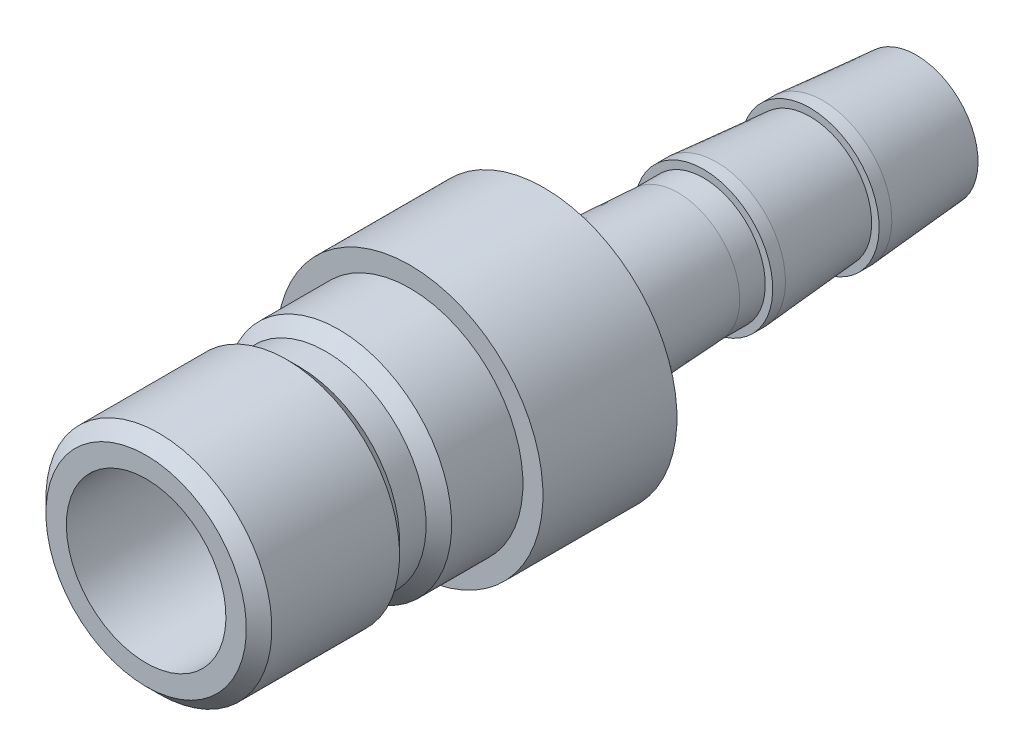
from build123d import *


with BuildPart() as part:
    # Sketch1 → Revolve1 (revolve)
    with BuildSketch(Plane(origin=(0, 0, 0), x_dir=(0, 0, -1), z_dir=(1, 0, 0))):
        Polygon((-15.748, 4.7625), (-15.748, 5.9817), (-14.986, 6.7437), (-7.366, 6.7437), (-6.604, 5.9817), (-5.0165, 5.9817), (-4.2545, 6.7437), (0, 6.7437), (0, 7.9375), (8.001, 7.9375), (8.001, 4.1275), (16.002, 3.683), (17.526, 3.683), (17.526, 4.1275), (18.288, 4.1275), (23.876, 3.683), (23.876, 4.1275), (24.638, 4.1275), (30.226, 3.683), (30.226, 3.175), (-0.691870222, 3.175), (-3.556, 4.7625), align=None)
    revolve(axis=Axis((0, 0, 0), (0, 0, 1)))


solid = part.part
